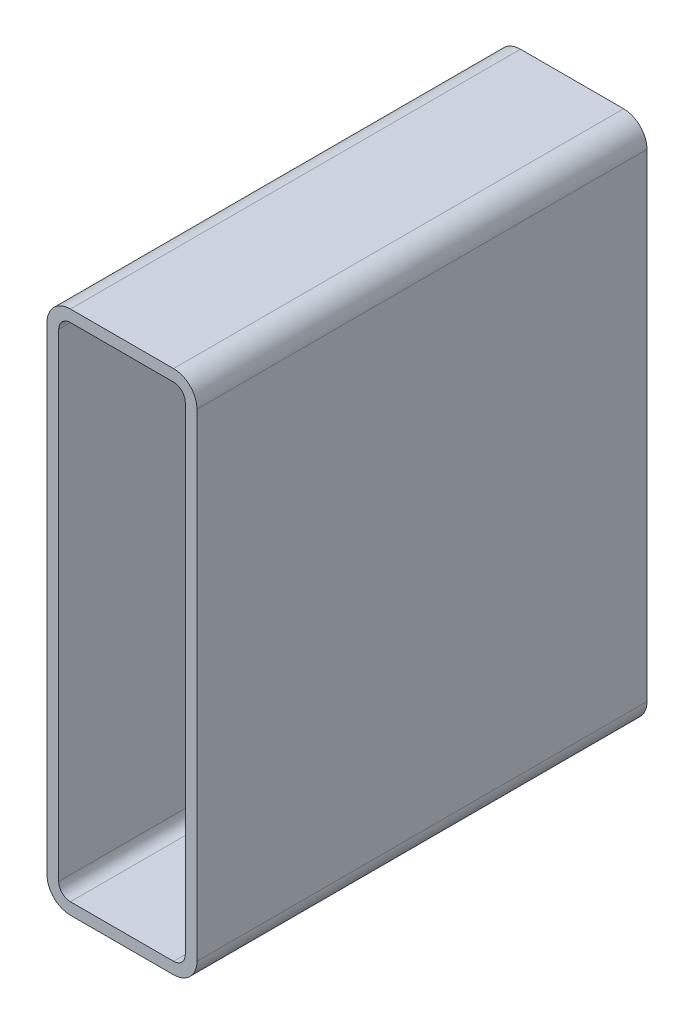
ISO-10303-21;
HEADER;
FILE_DESCRIPTION(('STEP AP214'),'2;1');
FILE_NAME('part.step','',(''),(''),'','','');
FILE_SCHEMA(('AUTOMOTIVE_DESIGN { 1 0 10303 214 1 1 1 1 }'));
ENDSEC;
DATA;
#1=APPLICATION_CONTEXT('core data for automotive mechanical design processes');
#2=APPLICATION_PROTOCOL_DEFINITION('international standard','automotive_design',2000,#1);
#3=PRODUCT_CONTEXT('',#1,'mechanical');
#4=PRODUCT('Part','Part','',(#3));
#5=PRODUCT_RELATED_PRODUCT_CATEGORY('part','',(#4));
#6=PRODUCT_DEFINITION_FORMATION('','',#4);
#7=PRODUCT_DEFINITION_CONTEXT('part definition',#1,'design');
#8=PRODUCT_DEFINITION('design','',#6,#7);
#9=PRODUCT_DEFINITION_SHAPE('','',#8);
#10=(LENGTH_UNIT() NAMED_UNIT(*) SI_UNIT(.MILLI.,.METRE.));
#11=(NAMED_UNIT(*) PLANE_ANGLE_UNIT() SI_UNIT($,.RADIAN.));
#12=(NAMED_UNIT(*) SI_UNIT($,.STERADIAN.) SOLID_ANGLE_UNIT());
#13=UNCERTAINTY_MEASURE_WITH_UNIT(LENGTH_MEASURE(1.E-05),#10,'distance_accuracy_value','');
#14=(GEOMETRIC_REPRESENTATION_CONTEXT(3) GLOBAL_UNCERTAINTY_ASSIGNED_CONTEXT((#13)) GLOBAL_UNIT_ASSIGNED_CONTEXT((#10,
#11,#12)) REPRESENTATION_CONTEXT('',''));
#15=CARTESIAN_POINT('',(0.,0.,0.));
#16=DIRECTION('',(0.,0.,1.));
#17=DIRECTION('',(1.,0.,0.));
#18=AXIS2_PLACEMENT_3D('',#15,#16,#17);
#19=CARTESIAN_POINT('',(17.5501778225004,341.553679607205,304.8));
#20=DIRECTION('',(0.,0.,1.));
#21=DIRECTION('',(1.,0.,0.));
#22=AXIS2_PLACEMENT_3D('',#19,#20,#21);
#23=PLANE('',#22);
#24=CARTESIAN_POINT('',(17.5501778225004,341.553679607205,304.8));
#25=DIRECTION('',(0.,0.,1.));
#26=DIRECTION('',(1.,0.,0.));
#27=AXIS2_PLACEMENT_3D('',#24,#25,#26);
#28=CIRCLE('',#27,15.875);
#29=CARTESIAN_POINT('',(17.5501778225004,357.428679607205,304.8));
#30=VERTEX_POINT('',#29);
#31=CARTESIAN_POINT('',(1.67517782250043,341.553679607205,304.8));
#32=VERTEX_POINT('',#31);
#33=EDGE_CURVE('E211',#30,#32,#28,.T.);
#34=ORIENTED_EDGE('',*,*,#33,.T.);
#35=DIRECTION('',(0.,-1.,0.));
#36=VECTOR('',#35,1.);
#37=CARTESIAN_POINT('',(1.67517782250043,17.7036796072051,304.8));
#38=LINE('',#37,#36);
#39=CARTESIAN_POINT('',(1.67517782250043,17.7036796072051,304.8));
#40=VERTEX_POINT('',#39);
#41=EDGE_CURVE('E214',#32,#40,#38,.T.);
#42=ORIENTED_EDGE('',*,*,#41,.T.);
#43=CARTESIAN_POINT('',(17.5501778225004,17.7036796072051,304.8));
#44=DIRECTION('',(0.,0.,1.));
#45=DIRECTION('',(1.,0.,0.));
#46=AXIS2_PLACEMENT_3D('',#43,#44,#45);
#47=CIRCLE('',#46,15.875);
#48=CARTESIAN_POINT('',(17.5501778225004,1.82867960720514,304.8));
#49=VERTEX_POINT('',#48);
#50=EDGE_CURVE('E217',#40,#49,#47,.T.);
#51=ORIENTED_EDGE('',*,*,#50,.T.);
#52=DIRECTION('',(1.,0.,0.));
#53=VECTOR('',#52,1.);
#54=CARTESIAN_POINT('',(87.4001778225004,1.82867960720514,304.8));
#55=LINE('',#54,#53);
#56=CARTESIAN_POINT('',(87.4001778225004,1.82867960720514,304.8));
#57=VERTEX_POINT('',#56);
#58=EDGE_CURVE('E219',#49,#57,#55,.T.);
#59=ORIENTED_EDGE('',*,*,#58,.T.);
#60=CARTESIAN_POINT('',(87.4001778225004,17.7036796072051,304.8));
#61=DIRECTION('',(0.,0.,1.));
#62=DIRECTION('',(1.,0.,0.));
#63=AXIS2_PLACEMENT_3D('',#60,#61,#62);
#64=CIRCLE('',#63,15.875);
#65=CARTESIAN_POINT('',(103.2751778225,17.7036796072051,304.8));
#66=VERTEX_POINT('',#65);
#67=EDGE_CURVE('E221',#57,#66,#64,.T.);
#68=ORIENTED_EDGE('',*,*,#67,.T.);
#69=DIRECTION('',(0.,1.,0.));
#70=VECTOR('',#69,1.);
#71=CARTESIAN_POINT('',(103.2751778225,341.553679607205,304.8));
#72=LINE('',#71,#70);
#73=CARTESIAN_POINT('',(103.2751778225,341.553679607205,304.8));
#74=VERTEX_POINT('',#73);
#75=EDGE_CURVE('E223',#66,#74,#72,.T.);
#76=ORIENTED_EDGE('',*,*,#75,.T.);
#77=CARTESIAN_POINT('',(87.4001778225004,341.553679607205,304.8));
#78=DIRECTION('',(0.,0.,1.));
#79=DIRECTION('',(1.,0.,0.));
#80=AXIS2_PLACEMENT_3D('',#77,#78,#79);
#81=CIRCLE('',#80,15.875);
#82=CARTESIAN_POINT('',(87.4001778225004,357.428679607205,304.8));
#83=VERTEX_POINT('',#82);
#84=EDGE_CURVE('E225',#74,#83,#81,.T.);
#85=ORIENTED_EDGE('',*,*,#84,.T.);
#86=DIRECTION('',(-1.,0.,0.));
#87=VECTOR('',#86,1.);
#88=CARTESIAN_POINT('',(17.5501778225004,357.428679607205,304.8));
#89=LINE('',#88,#87);
#90=EDGE_CURVE('E227',#83,#30,#89,.T.);
#91=ORIENTED_EDGE('',*,*,#90,.T.);
#92=EDGE_LOOP('',(#34,#42,#51,#59,#68,#76,#85,#91));
#93=FACE_BOUND('',#92,.T.);
#94=DIRECTION('',(0.,-1.,0.));
#95=VECTOR('',#94,1.);
#96=CARTESIAN_POINT('',(9.61267782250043,17.7036796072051,304.8));
#97=LINE('',#96,#95);
#98=CARTESIAN_POINT('',(9.61267782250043,341.553679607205,304.8));
#99=VERTEX_POINT('',#98);
#100=CARTESIAN_POINT('',(9.61267782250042,17.7036796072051,304.8));
#101=VERTEX_POINT('',#100);
#102=EDGE_CURVE('E154',#99,#101,#97,.T.);
#103=ORIENTED_EDGE('',*,*,#102,.F.);
#104=CARTESIAN_POINT('',(17.5501778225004,341.553679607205,304.8));
#105=DIRECTION('',(0.,0.,1.));
#106=DIRECTION('',(1.,0.,0.));
#107=AXIS2_PLACEMENT_3D('',#104,#105,#106);
#108=CIRCLE('',#107,7.93749999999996);
#109=CARTESIAN_POINT('',(17.5501778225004,349.491179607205,304.8));
#110=VERTEX_POINT('',#109);
#111=EDGE_CURVE('E146',#110,#99,#108,.T.);
#112=ORIENTED_EDGE('',*,*,#111,.F.);
#113=DIRECTION('',(-1.,0.,0.));
#114=VECTOR('',#113,1.);
#115=CARTESIAN_POINT('',(17.5501778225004,349.491179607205,304.8));
#116=LINE('',#115,#114);
#117=CARTESIAN_POINT('',(87.4001778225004,349.491179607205,304.8));
#118=VERTEX_POINT('',#117);
#119=EDGE_CURVE('E179',#118,#110,#116,.T.);
#120=ORIENTED_EDGE('',*,*,#119,.F.);
#121=CARTESIAN_POINT('',(87.4001778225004,341.553679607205,304.8));
#122=DIRECTION('',(0.,0.,1.));
#123=DIRECTION('',(1.,0.,0.));
#124=AXIS2_PLACEMENT_3D('',#121,#122,#123);
#125=CIRCLE('',#124,7.93749999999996);
#126=CARTESIAN_POINT('',(95.3376778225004,341.553679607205,304.8));
#127=VERTEX_POINT('',#126);
#128=EDGE_CURVE('E177',#127,#118,#125,.T.);
#129=ORIENTED_EDGE('',*,*,#128,.F.);
#130=DIRECTION('',(0.,1.,0.));
#131=VECTOR('',#130,1.);
#132=CARTESIAN_POINT('',(95.3376778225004,341.553679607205,304.8));
#133=LINE('',#132,#131);
#134=CARTESIAN_POINT('',(95.3376778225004,17.7036796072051,304.8));
#135=VERTEX_POINT('',#134);
#136=EDGE_CURVE('E175',#135,#127,#133,.T.);
#137=ORIENTED_EDGE('',*,*,#136,.F.);
#138=CARTESIAN_POINT('',(87.4001778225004,17.7036796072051,304.8));
#139=DIRECTION('',(0.,0.,1.));
#140=DIRECTION('',(1.,0.,0.));
#141=AXIS2_PLACEMENT_3D('',#138,#139,#140);
#142=CIRCLE('',#141,7.9375);
#143=CARTESIAN_POINT('',(87.4001778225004,9.76617960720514,304.8));
#144=VERTEX_POINT('',#143);
#145=EDGE_CURVE('E173',#144,#135,#142,.T.);
#146=ORIENTED_EDGE('',*,*,#145,.F.);
#147=DIRECTION('',(1.,0.,0.));
#148=VECTOR('',#147,1.);
#149=CARTESIAN_POINT('',(87.4001778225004,9.76617960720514,304.8));
#150=LINE('',#149,#148);
#151=CARTESIAN_POINT('',(17.5501778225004,9.76617960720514,304.8));
#152=VERTEX_POINT('',#151);
#153=EDGE_CURVE('E169',#152,#144,#150,.T.);
#154=ORIENTED_EDGE('',*,*,#153,.F.);
#155=CARTESIAN_POINT('',(17.5501778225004,17.7036796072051,304.8));
#156=DIRECTION('',(0.,0.,1.));
#157=DIRECTION('',(1.,0.,0.));
#158=AXIS2_PLACEMENT_3D('',#155,#156,#157);
#159=CIRCLE('',#158,7.9375);
#160=EDGE_CURVE('E167',#101,#152,#159,.T.);
#161=ORIENTED_EDGE('',*,*,#160,.F.);
#162=EDGE_LOOP('',(#103,#112,#120,#129,#137,#146,#154,#161));
#163=FACE_BOUND('',#162,.T.);
#164=ADVANCED_FACE('F33',(#93,#163),#23,.T.);
#165=CARTESIAN_POINT('',(17.5501778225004,341.553679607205,0.));
#166=DIRECTION('',(0.,0.,1.));
#167=DIRECTION('',(1.,0.,0.));
#168=AXIS2_PLACEMENT_3D('',#165,#166,#167);
#169=PLANE('',#168);
#170=CARTESIAN_POINT('',(17.5501778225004,341.553679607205,0.));
#171=DIRECTION('',(0.,0.,1.));
#172=DIRECTION('',(1.,0.,0.));
#173=AXIS2_PLACEMENT_3D('',#170,#171,#172);
#174=CIRCLE('',#173,15.875);
#175=CARTESIAN_POINT('',(17.5501778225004,357.428679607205,0.));
#176=VERTEX_POINT('',#175);
#177=CARTESIAN_POINT('',(1.67517782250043,341.553679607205,0.));
#178=VERTEX_POINT('',#177);
#179=EDGE_CURVE('E162',#176,#178,#174,.T.);
#180=ORIENTED_EDGE('',*,*,#179,.F.);
#181=DIRECTION('',(-1.,0.,0.));
#182=VECTOR('',#181,1.);
#183=CARTESIAN_POINT('',(17.5501778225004,357.428679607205,0.));
#184=LINE('',#183,#182);
#185=CARTESIAN_POINT('',(87.4001778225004,357.428679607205,0.));
#186=VERTEX_POINT('',#185);
#187=EDGE_CURVE('E215',#186,#176,#184,.T.);
#188=ORIENTED_EDGE('',*,*,#187,.F.);
#189=CARTESIAN_POINT('',(87.4001778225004,341.553679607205,0.));
#190=DIRECTION('',(0.,0.,1.));
#191=DIRECTION('',(1.,0.,0.));
#192=AXIS2_PLACEMENT_3D('',#189,#190,#191);
#193=CIRCLE('',#192,15.875);
#194=CARTESIAN_POINT('',(103.2751778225,341.553679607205,0.));
#195=VERTEX_POINT('',#194);
#196=EDGE_CURVE('E242',#195,#186,#193,.T.);
#197=ORIENTED_EDGE('',*,*,#196,.F.);
#198=DIRECTION('',(0.,1.,0.));
#199=VECTOR('',#198,1.);
#200=CARTESIAN_POINT('',(103.2751778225,341.553679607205,0.));
#201=LINE('',#200,#199);
#202=CARTESIAN_POINT('',(103.2751778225,17.7036796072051,0.));
#203=VERTEX_POINT('',#202);
#204=EDGE_CURVE('E240',#203,#195,#201,.T.);
#205=ORIENTED_EDGE('',*,*,#204,.F.);
#206=CARTESIAN_POINT('',(87.4001778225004,17.7036796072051,0.));
#207=DIRECTION('',(0.,0.,1.));
#208=DIRECTION('',(1.,0.,0.));
#209=AXIS2_PLACEMENT_3D('',#206,#207,#208);
#210=CIRCLE('',#209,15.875);
#211=CARTESIAN_POINT('',(87.4001778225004,1.82867960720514,0.));
#212=VERTEX_POINT('',#211);
#213=EDGE_CURVE('E238',#212,#203,#210,.T.);
#214=ORIENTED_EDGE('',*,*,#213,.F.);
#215=DIRECTION('',(1.,0.,0.));
#216=VECTOR('',#215,1.);
#217=CARTESIAN_POINT('',(87.4001778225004,1.82867960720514,0.));
#218=LINE('',#217,#216);
#219=CARTESIAN_POINT('',(17.5501778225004,1.82867960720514,0.));
#220=VERTEX_POINT('',#219);
#221=EDGE_CURVE('E236',#220,#212,#218,.T.);
#222=ORIENTED_EDGE('',*,*,#221,.F.);
#223=CARTESIAN_POINT('',(17.5501778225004,17.7036796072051,0.));
#224=DIRECTION('',(0.,0.,1.));
#225=DIRECTION('',(1.,0.,0.));
#226=AXIS2_PLACEMENT_3D('',#223,#224,#225);
#227=CIRCLE('',#226,15.875);
#228=CARTESIAN_POINT('',(1.67517782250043,17.7036796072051,0.));
#229=VERTEX_POINT('',#228);
#230=EDGE_CURVE('E234',#229,#220,#227,.T.);
#231=ORIENTED_EDGE('',*,*,#230,.F.);
#232=DIRECTION('',(0.,-1.,0.));
#233=VECTOR('',#232,1.);
#234=CARTESIAN_POINT('',(1.67517782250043,17.7036796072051,0.));
#235=LINE('',#234,#233);
#236=EDGE_CURVE('E232',#178,#229,#235,.T.);
#237=ORIENTED_EDGE('',*,*,#236,.F.);
#238=EDGE_LOOP('',(#180,#188,#197,#205,#214,#222,#231,#237));
#239=FACE_BOUND('',#238,.T.);
#240=CARTESIAN_POINT('',(17.5501778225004,341.553679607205,0.));
#241=DIRECTION('',(0.,0.,1.));
#242=DIRECTION('',(1.,0.,0.));
#243=AXIS2_PLACEMENT_3D('',#240,#241,#242);
#244=CIRCLE('',#243,7.93749999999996);
#245=CARTESIAN_POINT('',(17.5501778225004,349.491179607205,0.));
#246=VERTEX_POINT('',#245);
#247=CARTESIAN_POINT('',(9.61267782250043,341.553679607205,0.));
#248=VERTEX_POINT('',#247);
#249=EDGE_CURVE('E56',#246,#248,#244,.T.);
#250=ORIENTED_EDGE('',*,*,#249,.T.);
#251=DIRECTION('',(0.,-1.,0.));
#252=VECTOR('',#251,1.);
#253=CARTESIAN_POINT('',(9.61267782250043,17.7036796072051,0.));
#254=LINE('',#253,#252);
#255=CARTESIAN_POINT('',(9.61267782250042,17.7036796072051,0.));
#256=VERTEX_POINT('',#255);
#257=EDGE_CURVE('E161',#248,#256,#254,.T.);
#258=ORIENTED_EDGE('',*,*,#257,.T.);
#259=CARTESIAN_POINT('',(17.5501778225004,17.7036796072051,0.));
#260=DIRECTION('',(0.,0.,1.));
#261=DIRECTION('',(1.,0.,0.));
#262=AXIS2_PLACEMENT_3D('',#259,#260,#261);
#263=CIRCLE('',#262,7.9375);
#264=CARTESIAN_POINT('',(17.5501778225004,9.76617960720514,0.));
#265=VERTEX_POINT('',#264);
#266=EDGE_CURVE('E183',#256,#265,#263,.T.);
#267=ORIENTED_EDGE('',*,*,#266,.T.);
#268=DIRECTION('',(1.,0.,0.));
#269=VECTOR('',#268,1.);
#270=CARTESIAN_POINT('',(87.4001778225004,9.76617960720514,0.));
#271=LINE('',#270,#269);
#272=CARTESIAN_POINT('',(87.4001778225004,9.76617960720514,0.));
#273=VERTEX_POINT('',#272);
#274=EDGE_CURVE('E186',#265,#273,#271,.T.);
#275=ORIENTED_EDGE('',*,*,#274,.T.);
#276=CARTESIAN_POINT('',(87.4001778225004,17.7036796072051,0.));
#277=DIRECTION('',(0.,0.,1.));
#278=DIRECTION('',(1.,0.,0.));
#279=AXIS2_PLACEMENT_3D('',#276,#277,#278);
#280=CIRCLE('',#279,7.9375);
#281=CARTESIAN_POINT('',(95.3376778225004,17.7036796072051,0.));
#282=VERTEX_POINT('',#281);
#283=EDGE_CURVE('E189',#273,#282,#280,.T.);
#284=ORIENTED_EDGE('',*,*,#283,.T.);
#285=DIRECTION('',(0.,1.,0.));
#286=VECTOR('',#285,1.);
#287=CARTESIAN_POINT('',(95.3376778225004,341.553679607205,0.));
#288=LINE('',#287,#286);
#289=CARTESIAN_POINT('',(95.3376778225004,341.553679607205,0.));
#290=VERTEX_POINT('',#289);
#291=EDGE_CURVE('E192',#282,#290,#288,.T.);
#292=ORIENTED_EDGE('',*,*,#291,.T.);
#293=CARTESIAN_POINT('',(87.4001778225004,341.553679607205,0.));
#294=DIRECTION('',(0.,0.,1.));
#295=DIRECTION('',(1.,0.,0.));
#296=AXIS2_PLACEMENT_3D('',#293,#294,#295);
#297=CIRCLE('',#296,7.93749999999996);
#298=CARTESIAN_POINT('',(87.4001778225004,349.491179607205,0.));
#299=VERTEX_POINT('',#298);
#300=EDGE_CURVE('E195',#290,#299,#297,.T.);
#301=ORIENTED_EDGE('',*,*,#300,.T.);
#302=DIRECTION('',(-1.,0.,0.));
#303=VECTOR('',#302,1.);
#304=CARTESIAN_POINT('',(17.5501778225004,349.491179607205,0.));
#305=LINE('',#304,#303);
#306=EDGE_CURVE('E155',#299,#246,#305,.T.);
#307=ORIENTED_EDGE('',*,*,#306,.T.);
#308=EDGE_LOOP('',(#250,#258,#267,#275,#284,#292,#301,#307));
#309=FACE_BOUND('',#308,.T.);
#310=ADVANCED_FACE('F272',(#239,#309),#169,.F.);
#311=CARTESIAN_POINT('',(17.5501778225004,341.553679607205,304.8));
#312=DIRECTION('',(0.,0.,-1.));
#313=DIRECTION('',(-1.,0.,0.));
#314=AXIS2_PLACEMENT_3D('',#311,#312,#313);
#315=CYLINDRICAL_SURFACE('',#314,15.875);
#316=ORIENTED_EDGE('',*,*,#179,.T.);
#317=DIRECTION('',(0.,0.,-1.));
#318=VECTOR('',#317,1.);
#319=CARTESIAN_POINT('',(1.67517782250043,341.553679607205,304.8));
#320=LINE('',#319,#318);
#321=EDGE_CURVE('E11',#32,#178,#320,.T.);
#322=ORIENTED_EDGE('',*,*,#321,.F.);
#323=ORIENTED_EDGE('',*,*,#33,.F.);
#324=DIRECTION('',(0.,0.,-1.));
#325=VECTOR('',#324,1.);
#326=CARTESIAN_POINT('',(17.5501778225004,357.428679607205,304.8));
#327=LINE('',#326,#325);
#328=EDGE_CURVE('E229',#30,#176,#327,.T.);
#329=ORIENTED_EDGE('',*,*,#328,.T.);
#330=EDGE_LOOP('',(#316,#322,#323,#329));
#331=FACE_BOUND('',#330,.T.);
#332=ADVANCED_FACE('F35',(#331),#315,.T.);
#333=CARTESIAN_POINT('',(1.67517782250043,17.7036796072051,304.8));
#334=DIRECTION('',(1.,0.,0.));
#335=DIRECTION('',(0.,0.,-1.));
#336=AXIS2_PLACEMENT_3D('',#333,#334,#335);
#337=PLANE('',#336);
#338=ORIENTED_EDGE('',*,*,#236,.T.);
#339=DIRECTION('',(0.,0.,-1.));
#340=VECTOR('',#339,1.);
#341=CARTESIAN_POINT('',(1.67517782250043,17.7036796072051,304.8));
#342=LINE('',#341,#340);
#343=EDGE_CURVE('E41',#40,#229,#342,.T.);
#344=ORIENTED_EDGE('',*,*,#343,.F.);
#345=ORIENTED_EDGE('',*,*,#41,.F.);
#346=ORIENTED_EDGE('',*,*,#321,.T.);
#347=EDGE_LOOP('',(#338,#344,#345,#346));
#348=FACE_BOUND('',#347,.T.);
#349=ADVANCED_FACE('F289',(#348),#337,.F.);
#350=CARTESIAN_POINT('',(17.5501778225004,17.7036796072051,304.8));
#351=DIRECTION('',(0.,0.,-1.));
#352=DIRECTION('',(-1.,0.,0.));
#353=AXIS2_PLACEMENT_3D('',#350,#351,#352);
#354=CYLINDRICAL_SURFACE('',#353,15.875);
#355=ORIENTED_EDGE('',*,*,#230,.T.);
#356=DIRECTION('',(0.,0.,-1.));
#357=VECTOR('',#356,1.);
#358=CARTESIAN_POINT('',(17.5501778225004,1.82867960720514,304.8));
#359=LINE('',#358,#357);
#360=EDGE_CURVE('E259',#49,#220,#359,.T.);
#361=ORIENTED_EDGE('',*,*,#360,.F.);
#362=ORIENTED_EDGE('',*,*,#50,.F.);
#363=ORIENTED_EDGE('',*,*,#343,.T.);
#364=EDGE_LOOP('',(#355,#361,#362,#363));
#365=FACE_BOUND('',#364,.T.);
#366=ADVANCED_FACE('F266',(#365),#354,.T.);
#367=CARTESIAN_POINT('',(87.4001778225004,1.82867960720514,304.8));
#368=DIRECTION('',(0.,1.,0.));
#369=DIRECTION('',(0.,0.,1.));
#370=AXIS2_PLACEMENT_3D('',#367,#368,#369);
#371=PLANE('',#370);
#372=ORIENTED_EDGE('',*,*,#221,.T.);
#373=DIRECTION('',(0.,0.,-1.));
#374=VECTOR('',#373,1.);
#375=CARTESIAN_POINT('',(87.4001778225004,1.82867960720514,304.8));
#376=LINE('',#375,#374);
#377=EDGE_CURVE('E256',#57,#212,#376,.T.);
#378=ORIENTED_EDGE('',*,*,#377,.F.);
#379=ORIENTED_EDGE('',*,*,#58,.F.);
#380=ORIENTED_EDGE('',*,*,#360,.T.);
#381=EDGE_LOOP('',(#372,#378,#379,#380));
#382=FACE_BOUND('',#381,.T.);
#383=ADVANCED_FACE('F278',(#382),#371,.F.);
#384=CARTESIAN_POINT('',(87.4001778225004,17.7036796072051,304.8));
#385=DIRECTION('',(0.,0.,-1.));
#386=DIRECTION('',(-1.,0.,0.));
#387=AXIS2_PLACEMENT_3D('',#384,#385,#386);
#388=CYLINDRICAL_SURFACE('',#387,15.875);
#389=ORIENTED_EDGE('',*,*,#213,.T.);
#390=DIRECTION('',(0.,0.,-1.));
#391=VECTOR('',#390,1.);
#392=CARTESIAN_POINT('',(103.2751778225,17.7036796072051,304.8));
#393=LINE('',#392,#391);
#394=EDGE_CURVE('E253',#66,#203,#393,.T.);
#395=ORIENTED_EDGE('',*,*,#394,.F.);
#396=ORIENTED_EDGE('',*,*,#67,.F.);
#397=ORIENTED_EDGE('',*,*,#377,.T.);
#398=EDGE_LOOP('',(#389,#395,#396,#397));
#399=FACE_BOUND('',#398,.T.);
#400=ADVANCED_FACE('F282',(#399),#388,.T.);
#401=CARTESIAN_POINT('',(103.2751778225,341.553679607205,304.8));
#402=DIRECTION('',(-1.,0.,0.));
#403=DIRECTION('',(0.,0.,1.));
#404=AXIS2_PLACEMENT_3D('',#401,#402,#403);
#405=PLANE('',#404);
#406=ORIENTED_EDGE('',*,*,#204,.T.);
#407=DIRECTION('',(0.,0.,-1.));
#408=VECTOR('',#407,1.);
#409=CARTESIAN_POINT('',(103.2751778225,341.553679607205,304.8));
#410=LINE('',#409,#408);
#411=EDGE_CURVE('E250',#74,#195,#410,.T.);
#412=ORIENTED_EDGE('',*,*,#411,.F.);
#413=ORIENTED_EDGE('',*,*,#75,.F.);
#414=ORIENTED_EDGE('',*,*,#394,.T.);
#415=EDGE_LOOP('',(#406,#412,#413,#414));
#416=FACE_BOUND('',#415,.T.);
#417=ADVANCED_FACE('F302',(#416),#405,.F.);
#418=CARTESIAN_POINT('',(87.4001778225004,341.553679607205,304.8));
#419=DIRECTION('',(0.,0.,-1.));
#420=DIRECTION('',(-1.,0.,0.));
#421=AXIS2_PLACEMENT_3D('',#418,#419,#420);
#422=CYLINDRICAL_SURFACE('',#421,15.875);
#423=ORIENTED_EDGE('',*,*,#196,.T.);
#424=DIRECTION('',(0.,0.,-1.));
#425=VECTOR('',#424,1.);
#426=CARTESIAN_POINT('',(87.4001778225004,357.428679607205,304.8));
#427=LINE('',#426,#425);
#428=EDGE_CURVE('E247',#83,#186,#427,.T.);
#429=ORIENTED_EDGE('',*,*,#428,.F.);
#430=ORIENTED_EDGE('',*,*,#84,.F.);
#431=ORIENTED_EDGE('',*,*,#411,.T.);
#432=EDGE_LOOP('',(#423,#429,#430,#431));
#433=FACE_BOUND('',#432,.T.);
#434=ADVANCED_FACE('F300',(#433),#422,.T.);
#435=CARTESIAN_POINT('',(17.5501778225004,357.428679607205,304.8));
#436=DIRECTION('',(0.,-1.,0.));
#437=DIRECTION('',(0.,0.,-1.));
#438=AXIS2_PLACEMENT_3D('',#435,#436,#437);
#439=PLANE('',#438);
#440=ORIENTED_EDGE('',*,*,#187,.T.);
#441=ORIENTED_EDGE('',*,*,#328,.F.);
#442=ORIENTED_EDGE('',*,*,#90,.F.);
#443=ORIENTED_EDGE('',*,*,#428,.T.);
#444=EDGE_LOOP('',(#440,#441,#442,#443));
#445=FACE_BOUND('',#444,.T.);
#446=ADVANCED_FACE('F295',(#445),#439,.F.);
#447=CARTESIAN_POINT('',(17.5501778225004,341.553679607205,304.8));
#448=DIRECTION('',(0.,0.,-1.));
#449=DIRECTION('',(-1.,0.,0.));
#450=AXIS2_PLACEMENT_3D('',#447,#448,#449);
#451=CYLINDRICAL_SURFACE('',#450,7.93749999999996);
#452=ORIENTED_EDGE('',*,*,#249,.F.);
#453=DIRECTION('',(0.,0.,-1.));
#454=VECTOR('',#453,1.);
#455=CARTESIAN_POINT('',(17.5501778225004,349.491179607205,304.8));
#456=LINE('',#455,#454);
#457=EDGE_CURVE('E150',#110,#246,#456,.T.);
#458=ORIENTED_EDGE('',*,*,#457,.F.);
#459=ORIENTED_EDGE('',*,*,#111,.T.);
#460=DIRECTION('',(0.,0.,-1.));
#461=VECTOR('',#460,1.);
#462=CARTESIAN_POINT('',(9.61267782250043,341.553679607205,304.8));
#463=LINE('',#462,#461);
#464=EDGE_CURVE('E149',#99,#248,#463,.T.);
#465=ORIENTED_EDGE('',*,*,#464,.T.);
#466=EDGE_LOOP('',(#452,#458,#459,#465));
#467=FACE_BOUND('',#466,.T.);
#468=ADVANCED_FACE('F148',(#467),#451,.F.);
#469=CARTESIAN_POINT('',(9.61267782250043,17.7036796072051,304.8));
#470=DIRECTION('',(1.,0.,0.));
#471=DIRECTION('',(0.,0.,-1.));
#472=AXIS2_PLACEMENT_3D('',#469,#470,#471);
#473=PLANE('',#472);
#474=ORIENTED_EDGE('',*,*,#257,.F.);
#475=ORIENTED_EDGE('',*,*,#464,.F.);
#476=ORIENTED_EDGE('',*,*,#102,.T.);
#477=DIRECTION('',(0.,0.,-1.));
#478=VECTOR('',#477,1.);
#479=CARTESIAN_POINT('',(9.61267782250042,17.7036796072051,304.8));
#480=LINE('',#479,#478);
#481=EDGE_CURVE('E163',#101,#256,#480,.T.);
#482=ORIENTED_EDGE('',*,*,#481,.T.);
#483=EDGE_LOOP('',(#474,#475,#476,#482));
#484=FACE_BOUND('',#483,.T.);
#485=ADVANCED_FACE('F158',(#484),#473,.T.);
#486=CARTESIAN_POINT('',(17.5501778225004,17.7036796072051,304.8));
#487=DIRECTION('',(0.,0.,-1.));
#488=DIRECTION('',(-1.,0.,0.));
#489=AXIS2_PLACEMENT_3D('',#486,#487,#488);
#490=CYLINDRICAL_SURFACE('',#489,7.9375);
#491=ORIENTED_EDGE('',*,*,#266,.F.);
#492=ORIENTED_EDGE('',*,*,#481,.F.);
#493=ORIENTED_EDGE('',*,*,#160,.T.);
#494=DIRECTION('',(0.,0.,-1.));
#495=VECTOR('',#494,1.);
#496=CARTESIAN_POINT('',(17.5501778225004,9.76617960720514,304.8));
#497=LINE('',#496,#495);
#498=EDGE_CURVE('E208',#152,#265,#497,.T.);
#499=ORIENTED_EDGE('',*,*,#498,.T.);
#500=EDGE_LOOP('',(#491,#492,#493,#499));
#501=FACE_BOUND('',#500,.T.);
#502=ADVANCED_FACE('F327',(#501),#490,.F.);
#503=CARTESIAN_POINT('',(87.4001778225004,9.76617960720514,304.8));
#504=DIRECTION('',(0.,1.,0.));
#505=DIRECTION('',(0.,0.,1.));
#506=AXIS2_PLACEMENT_3D('',#503,#504,#505);
#507=PLANE('',#506);
#508=ORIENTED_EDGE('',*,*,#274,.F.);
#509=ORIENTED_EDGE('',*,*,#498,.F.);
#510=ORIENTED_EDGE('',*,*,#153,.T.);
#511=DIRECTION('',(0.,0.,-1.));
#512=VECTOR('',#511,1.);
#513=CARTESIAN_POINT('',(87.4001778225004,9.76617960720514,304.8));
#514=LINE('',#513,#512);
#515=EDGE_CURVE('E206',#144,#273,#514,.T.);
#516=ORIENTED_EDGE('',*,*,#515,.T.);
#517=EDGE_LOOP('',(#508,#509,#510,#516));
#518=FACE_BOUND('',#517,.T.);
#519=ADVANCED_FACE('F331',(#518),#507,.T.);
#520=CARTESIAN_POINT('',(87.4001778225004,17.7036796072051,304.8));
#521=DIRECTION('',(0.,0.,-1.));
#522=DIRECTION('',(-1.,0.,0.));
#523=AXIS2_PLACEMENT_3D('',#520,#521,#522);
#524=CYLINDRICAL_SURFACE('',#523,7.9375);
#525=ORIENTED_EDGE('',*,*,#283,.F.);
#526=ORIENTED_EDGE('',*,*,#515,.F.);
#527=ORIENTED_EDGE('',*,*,#145,.T.);
#528=DIRECTION('',(0.,0.,-1.));
#529=VECTOR('',#528,1.);
#530=CARTESIAN_POINT('',(95.3376778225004,17.7036796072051,304.8));
#531=LINE('',#530,#529);
#532=EDGE_CURVE('E204',#135,#282,#531,.T.);
#533=ORIENTED_EDGE('',*,*,#532,.T.);
#534=EDGE_LOOP('',(#525,#526,#527,#533));
#535=FACE_BOUND('',#534,.T.);
#536=ADVANCED_FACE('F337',(#535),#524,.F.);
#537=CARTESIAN_POINT('',(95.3376778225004,341.553679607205,304.8));
#538=DIRECTION('',(-1.,0.,0.));
#539=DIRECTION('',(0.,0.,1.));
#540=AXIS2_PLACEMENT_3D('',#537,#538,#539);
#541=PLANE('',#540);
#542=ORIENTED_EDGE('',*,*,#291,.F.);
#543=ORIENTED_EDGE('',*,*,#532,.F.);
#544=ORIENTED_EDGE('',*,*,#136,.T.);
#545=DIRECTION('',(0.,0.,-1.));
#546=VECTOR('',#545,1.);
#547=CARTESIAN_POINT('',(95.3376778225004,341.553679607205,304.8));
#548=LINE('',#547,#546);
#549=EDGE_CURVE('E202',#127,#290,#548,.T.);
#550=ORIENTED_EDGE('',*,*,#549,.T.);
#551=EDGE_LOOP('',(#542,#543,#544,#550));
#552=FACE_BOUND('',#551,.T.);
#553=ADVANCED_FACE('F341',(#552),#541,.T.);
#554=CARTESIAN_POINT('',(87.4001778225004,341.553679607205,304.8));
#555=DIRECTION('',(0.,0.,-1.));
#556=DIRECTION('',(-1.,0.,0.));
#557=AXIS2_PLACEMENT_3D('',#554,#555,#556);
#558=CYLINDRICAL_SURFACE('',#557,7.93749999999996);
#559=ORIENTED_EDGE('',*,*,#300,.F.);
#560=ORIENTED_EDGE('',*,*,#549,.F.);
#561=ORIENTED_EDGE('',*,*,#128,.T.);
#562=DIRECTION('',(0.,0.,-1.));
#563=VECTOR('',#562,1.);
#564=CARTESIAN_POINT('',(87.4001778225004,349.491179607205,304.8));
#565=LINE('',#564,#563);
#566=EDGE_CURVE('E48',#118,#299,#565,.T.);
#567=ORIENTED_EDGE('',*,*,#566,.T.);
#568=EDGE_LOOP('',(#559,#560,#561,#567));
#569=FACE_BOUND('',#568,.T.);
#570=ADVANCED_FACE('F345',(#569),#558,.F.);
#571=CARTESIAN_POINT('',(17.5501778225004,349.491179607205,304.8));
#572=DIRECTION('',(0.,-1.,0.));
#573=DIRECTION('',(0.,0.,-1.));
#574=AXIS2_PLACEMENT_3D('',#571,#572,#573);
#575=PLANE('',#574);
#576=ORIENTED_EDGE('',*,*,#306,.F.);
#577=ORIENTED_EDGE('',*,*,#566,.F.);
#578=ORIENTED_EDGE('',*,*,#119,.T.);
#579=ORIENTED_EDGE('',*,*,#457,.T.);
#580=EDGE_LOOP('',(#576,#577,#578,#579));
#581=FACE_BOUND('',#580,.T.);
#582=ADVANCED_FACE('F349',(#581),#575,.T.);
#583=CLOSED_SHELL('',(#164,#310,#332,#349,#366,#383,#400,#417,#434,#446,#468,#485,#502,#519,
#536,#553,#570,#582));
#584=MANIFOLD_SOLID_BREP('B2',#583);
#585=ADVANCED_BREP_SHAPE_REPRESENTATION('',(#18,#584),#14);
#586=SHAPE_DEFINITION_REPRESENTATION(#9,#585);
ENDSEC;
END-ISO-10303-21;
